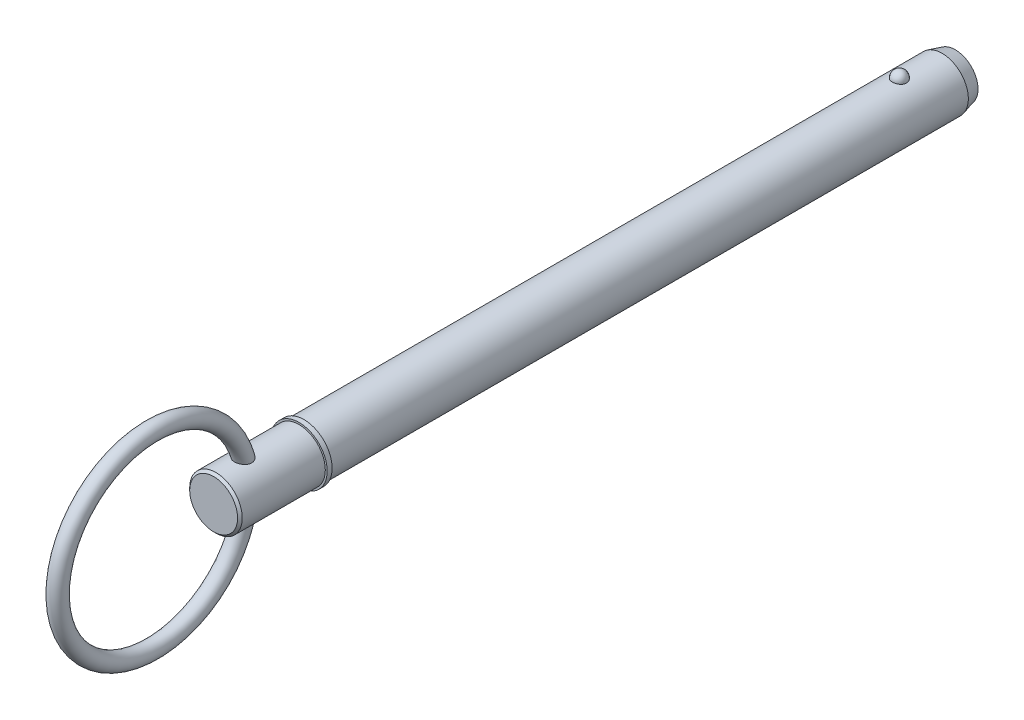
ISO-10303-21;
HEADER;
FILE_DESCRIPTION(('STEP AP214'),'2;1');
FILE_NAME('part.step','',(''),(''),'','','');
FILE_SCHEMA(('AUTOMOTIVE_DESIGN { 1 0 10303 214 1 1 1 1 }'));
ENDSEC;
DATA;
#1=APPLICATION_CONTEXT('core data for automotive mechanical design processes');
#2=APPLICATION_PROTOCOL_DEFINITION('international standard','automotive_design',2000,#1);
#3=PRODUCT_CONTEXT('',#1,'mechanical');
#4=PRODUCT('Part','Part','',(#3));
#5=PRODUCT_RELATED_PRODUCT_CATEGORY('part','',(#4));
#6=PRODUCT_DEFINITION_FORMATION('','',#4);
#7=PRODUCT_DEFINITION_CONTEXT('part definition',#1,'design');
#8=PRODUCT_DEFINITION('design','',#6,#7);
#9=PRODUCT_DEFINITION_SHAPE('','',#8);
#10=(LENGTH_UNIT() NAMED_UNIT(*) SI_UNIT(.MILLI.,.METRE.));
#11=(NAMED_UNIT(*) PLANE_ANGLE_UNIT() SI_UNIT($,.RADIAN.));
#12=(NAMED_UNIT(*) SI_UNIT($,.STERADIAN.) SOLID_ANGLE_UNIT());
#13=UNCERTAINTY_MEASURE_WITH_UNIT(LENGTH_MEASURE(1.E-05),#10,'distance_accuracy_value','');
#14=(GEOMETRIC_REPRESENTATION_CONTEXT(3) GLOBAL_UNCERTAINTY_ASSIGNED_CONTEXT((#13)) GLOBAL_UNIT_ASSIGNED_CONTEXT((#10,
#11,#12)) REPRESENTATION_CONTEXT('',''));
#15=CARTESIAN_POINT('',(0.,0.,0.));
#16=DIRECTION('',(0.,0.,1.));
#17=DIRECTION('',(1.,0.,0.));
#18=AXIS2_PLACEMENT_3D('',#15,#16,#17);
#19=CARTESIAN_POINT('',(0.,0.,177.8));
#20=DIRECTION('',(0.,0.,-1.));
#21=DIRECTION('',(-1.,0.,0.));
#22=AXIS2_PLACEMENT_3D('',#19,#20,#21);
#23=CYLINDRICAL_SURFACE('',#22,7.94);
#24=CARTESIAN_POINT('',(2.13020349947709,7.64891057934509,-2.14999999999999));
#25=CARTESIAN_POINT('',(2.1302012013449,7.64891247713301,-2.02978166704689));
#26=CARTESIAN_POINT('',(2.12037546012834,7.65166842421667,-1.90953383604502));
#27=CARTESIAN_POINT('',(2.08130792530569,7.66238579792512,-1.67243962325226));
#28=CARTESIAN_POINT('',(2.05205785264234,7.67034944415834,-1.55559471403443));
#29=CARTESIAN_POINT('',(1.97489181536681,7.69057749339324,-1.32869361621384));
#30=CARTESIAN_POINT('',(1.92698409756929,7.70283999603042,-1.21863445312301));
#31=CARTESIAN_POINT('',(1.81370645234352,7.73029430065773,-1.00831338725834));
#32=CARTESIAN_POINT('',(1.74833715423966,7.7454859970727,-0.908051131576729));
#33=CARTESIAN_POINT('',(1.60144242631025,7.77718699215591,-0.719628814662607));
#34=CARTESIAN_POINT('',(1.51984382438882,7.7937020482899,-0.631526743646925));
#35=CARTESIAN_POINT('',(1.34279837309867,7.82614685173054,-0.470411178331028));
#36=CARTESIAN_POINT('',(1.24735148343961,7.84207659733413,-0.397397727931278));
#37=CARTESIAN_POINT('',(1.04544839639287,7.87153116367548,-0.268681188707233));
#38=CARTESIAN_POINT('',(0.939022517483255,7.88506234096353,-0.212932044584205));
#39=CARTESIAN_POINT('',(0.717931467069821,7.90825597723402,-0.120080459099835));
#40=CARTESIAN_POINT('',(0.603267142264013,7.9179188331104,-0.0829761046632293));
#41=CARTESIAN_POINT('',(0.371015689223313,7.93216561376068,-0.0289596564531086));
#42=CARTESIAN_POINT('',(0.253510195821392,7.93683225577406,-0.0117183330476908));
#43=CARTESIAN_POINT('',(0.0171784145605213,7.94086051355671,0.00318921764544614));
#44=CARTESIAN_POINT('',(-0.101647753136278,7.94022260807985,0.000857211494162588));
#45=CARTESIAN_POINT('',(-0.335567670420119,7.93375751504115,-0.023146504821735));
#46=CARTESIAN_POINT('',(-0.450690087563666,7.92799987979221,-0.0445590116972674));
#47=CARTESIAN_POINT('',(-0.675610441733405,7.91200792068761,-0.10576054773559));
#48=CARTESIAN_POINT('',(-0.785408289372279,7.90177352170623,-0.145549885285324));
#49=CARTESIAN_POINT('',(-0.9972706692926,7.87784802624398,-0.242675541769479));
#50=CARTESIAN_POINT('',(-1.0992893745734,7.86413823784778,-0.300107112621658));
#51=CARTESIAN_POINT('',(-1.29223659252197,7.83474718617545,-0.430887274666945));
#52=CARTESIAN_POINT('',(-1.38316404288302,7.81906573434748,-0.504237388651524));
#53=CARTESIAN_POINT('',(-1.55313516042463,7.78710451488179,-0.666358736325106));
#54=CARTESIAN_POINT('',(-1.63193689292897,7.77081906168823,-0.755382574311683));
#55=CARTESIAN_POINT('',(-1.77366356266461,7.73970270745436,-0.945507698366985));
#56=CARTESIAN_POINT('',(-1.83658745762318,7.72487190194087,-1.04660977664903));
#57=CARTESIAN_POINT('',(-1.94556640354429,7.6981535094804,-1.25927689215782));
#58=CARTESIAN_POINT('',(-1.99143480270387,7.6862989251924,-1.3709418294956));
#59=CARTESIAN_POINT('',(-2.06418311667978,7.66708387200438,-1.60066153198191));
#60=CARTESIAN_POINT('',(-2.0910635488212,7.65972328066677,-1.71871612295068));
#61=CARTESIAN_POINT('',(-2.12508507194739,7.65035479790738,-1.9573607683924));
#62=CARTESIAN_POINT('',(-2.13230490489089,7.64832555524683,-2.07793875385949));
#63=CARTESIAN_POINT('',(-2.12704767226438,7.64978921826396,-2.31862835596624));
#64=CARTESIAN_POINT('',(-2.1145710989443,7.6532819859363,-2.43873998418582));
#65=CARTESIAN_POINT('',(-2.07034166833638,7.66536368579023,-2.67451689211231));
#66=CARTESIAN_POINT('',(-2.03867758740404,7.67392914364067,-2.79020005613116));
#67=CARTESIAN_POINT('',(-1.95694065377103,7.69517736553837,-3.01446692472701));
#68=CARTESIAN_POINT('',(-1.90686710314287,7.70786028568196,-3.12305035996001));
#69=CARTESIAN_POINT('',(-1.78925555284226,7.73600831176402,-3.33065971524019));
#70=CARTESIAN_POINT('',(-1.72162904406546,7.75148739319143,-3.42963360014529));
#71=CARTESIAN_POINT('',(-1.57074739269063,7.78346215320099,-3.61466914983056));
#72=CARTESIAN_POINT('',(-1.48749169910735,7.79995786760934,-3.70073035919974));
#73=CARTESIAN_POINT('',(-1.30720250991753,7.83219119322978,-3.8578359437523));
#74=CARTESIAN_POINT('',(-1.2101234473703,7.84792605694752,-3.92882863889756));
#75=CARTESIAN_POINT('',(-1.00503150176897,7.87681523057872,-4.05342383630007));
#76=CARTESIAN_POINT('',(-0.897019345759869,7.88996971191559,-4.10702749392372));
#77=CARTESIAN_POINT('',(-0.674439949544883,7.91208451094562,-4.19477736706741));
#78=CARTESIAN_POINT('',(-0.55996501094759,7.92109245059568,-4.22914554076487));
#79=CARTESIAN_POINT('',(-0.326625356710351,7.93413878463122,-4.27838865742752));
#80=CARTESIAN_POINT('',(-0.20776113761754,7.93817773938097,-4.29326579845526));
#81=CARTESIAN_POINT('',(0.0287357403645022,7.94081322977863,-4.3030062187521));
#82=CARTESIAN_POINT('',(0.14635312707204,7.93950453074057,-4.29821797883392));
#83=CARTESIAN_POINT('',(0.379062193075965,7.93180098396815,-4.26955229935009));
#84=CARTESIAN_POINT('',(0.494153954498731,7.92540630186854,-4.24567548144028));
#85=CARTESIAN_POINT('',(0.718185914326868,7.90824874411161,-4.17962260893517));
#86=CARTESIAN_POINT('',(0.827145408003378,7.89750055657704,-4.13750805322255));
#87=CARTESIAN_POINT('',(1.03638036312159,7.87277755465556,-4.03615078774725));
#88=CARTESIAN_POINT('',(1.13665531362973,7.85880255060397,-3.97690707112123));
#89=CARTESIAN_POINT('',(1.32729731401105,7.82887859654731,-3.84189297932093));
#90=CARTESIAN_POINT('',(1.41749828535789,7.81290379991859,-3.76589388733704));
#91=CARTESIAN_POINT('',(1.58397257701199,7.78086330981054,-3.59992466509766));
#92=CARTESIAN_POINT('',(1.66024342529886,7.76479760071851,-3.50995206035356));
#93=CARTESIAN_POINT('',(1.79805631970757,7.73405928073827,-3.3168832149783));
#94=CARTESIAN_POINT('',(1.85933944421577,7.719413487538,-3.213597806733));
#95=CARTESIAN_POINT('',(1.96397499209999,7.69345992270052,-2.99796163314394));
#96=CARTESIAN_POINT('',(2.00733488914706,7.68215076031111,-2.88561466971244));
#97=CARTESIAN_POINT('',(2.07068045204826,7.66529896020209,-2.6699413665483));
#98=CARTESIAN_POINT('',(2.09296296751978,7.65919990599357,-2.56732606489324));
#99=CARTESIAN_POINT('',(2.12272535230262,7.65100492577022,-2.35981463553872));
#100=CARTESIAN_POINT('',(2.13020550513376,7.64890892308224,-2.25491855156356));
#101=CARTESIAN_POINT('',(2.13020349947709,7.64891057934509,-2.14999999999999));
#102=B_SPLINE_CURVE_WITH_KNOTS('',3,(#24,#25,#26,#27,#28,#29,#30,#31,#32,#33,#34,#35,#36,#37,
#38,#39,#40,#41,#42,#43,#44,#45,#46,#47,#48,#49,#50,#51,#52,#53,#54,#55,#56,#57,#58,#59,#60,#61,
#62,#63,#64,#65,#66,#67,#68,#69,#70,#71,#72,#73,#74,#75,#76,#77,#78,#79,#80,#81,#82,#83,#84,#85,
#86,#87,#88,#89,#90,#91,#92,#93,#94,#95,#96,#97,#98,#99,#100,#101),.UNSPECIFIED.,.T.,.F.,(4,2,2,
2,2,2,2,2,2,2,2,2,2,2,2,2,2,2,2,2,2,2,2,2,2,2,2,2,2,2,2,2,2,2,2,2,2,2,4),(0.,0.360277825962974,
0.720709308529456,1.0809816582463,1.44124102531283,1.80316307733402,2.16508618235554,
2.52603531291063,2.88694740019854,3.24178717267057,3.59659491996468,3.94665496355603,
4.29672088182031,4.64871108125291,5.0007349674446,5.3590619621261,5.71741247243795,
6.079576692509,6.44173104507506,6.80243279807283,7.16312553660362,7.52216203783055,
7.88121215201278,8.24210915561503,8.60301888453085,8.96514709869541,9.32725124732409,
9.68508606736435,10.0428805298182,10.3943622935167,10.7458326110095,11.0961268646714,
11.4464417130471,11.8018724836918,12.1573662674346,12.5186252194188,12.8797333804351,
13.1941658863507,13.5085923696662),.UNSPECIFIED.);
#103=CARTESIAN_POINT('',(2.13020349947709,7.64891057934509,-2.14999999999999));
#104=VERTEX_POINT('',#103);
#105=EDGE_CURVE('E102',#104,#104,#102,.T.);
#106=ORIENTED_EDGE('',*,*,#105,.T.);
#107=EDGE_LOOP('',(#106));
#108=FACE_BOUND('',#107,.T.);
#109=CARTESIAN_POINT('',(0.,0.,-15.05));
#110=DIRECTION('',(0.,0.,-1.));
#111=DIRECTION('',(-1.,0.,0.));
#112=AXIS2_PLACEMENT_3D('',#109,#110,#111);
#113=CIRCLE('',#112,7.94);
#114=CARTESIAN_POINT('',(-7.94,0.,-15.05));
#115=VERTEX_POINT('',#114);
#116=EDGE_CURVE('E110',#115,#115,#113,.F.);
#117=ORIENTED_EDGE('',*,*,#116,.T.);
#118=EDGE_LOOP('',(#117));
#119=FACE_BOUND('',#118,.T.);
#120=CARTESIAN_POINT('',(0.,0.,177.8));
#121=DIRECTION('',(0.,0.,1.));
#122=DIRECTION('',(1.,0.,0.));
#123=AXIS2_PLACEMENT_3D('',#120,#121,#122);
#124=CIRCLE('',#123,7.94);
#125=CARTESIAN_POINT('',(7.94,0.,177.8));
#126=VERTEX_POINT('',#125);
#127=EDGE_CURVE('E108',#126,#126,#124,.T.);
#128=ORIENTED_EDGE('',*,*,#127,.F.);
#129=EDGE_LOOP('',(#128));
#130=FACE_BOUND('',#129,.T.);
#131=ADVANCED_FACE('F39',(#108,#119,#130),#23,.T.);
#132=CARTESIAN_POINT('',(0.,0.,-19.05));
#133=DIRECTION('',(0.,0.,-1.));
#134=DIRECTION('',(-1.,0.,0.));
#135=AXIS2_PLACEMENT_3D('',#132,#133,#134);
#136=PLANE('',#135);
#137=CARTESIAN_POINT('',(0.,0.,-19.05));
#138=DIRECTION('',(0.,0.,-1.));
#139=DIRECTION('',(-1.,0.,0.));
#140=AXIS2_PLACEMENT_3D('',#137,#138,#139);
#141=CIRCLE('',#140,6.86820323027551);
#142=CARTESIAN_POINT('',(-6.86820323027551,0.,-19.05));
#143=VERTEX_POINT('',#142);
#144=EDGE_CURVE('E142',#143,#143,#141,.T.);
#145=ORIENTED_EDGE('',*,*,#144,.T.);
#146=EDGE_LOOP('',(#145));
#147=FACE_BOUND('',#146,.T.);
#148=ADVANCED_FACE('F88',(#147),#136,.T.);
#149=CARTESIAN_POINT('',(0.,0.,-19.05));
#150=DIRECTION('',(0.,0.,1.));
#151=DIRECTION('',(1.,0.,0.));
#152=AXIS2_PLACEMENT_3D('',#149,#150,#151);
#153=CONICAL_SURFACE('',#152,6.86820323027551,0.261799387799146);
#154=ORIENTED_EDGE('',*,*,#116,.F.);
#155=EDGE_LOOP('',(#154));
#156=FACE_BOUND('',#155,.T.);
#157=ORIENTED_EDGE('',*,*,#144,.F.);
#158=EDGE_LOOP('',(#157));
#159=FACE_BOUND('',#158,.T.);
#160=ADVANCED_FACE('F94',(#156,#159),#153,.T.);
#161=CARTESIAN_POINT('',(0.,7.94,-2.14999999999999));
#162=DIRECTION('',(0.,1.,0.));
#163=DIRECTION('',(0.,0.,1.));
#164=AXIS2_PLACEMENT_3D('',#161,#162,#163);
#165=SPHERICAL_SURFACE('',#164,2.15);
#166=ORIENTED_EDGE('',*,*,#105,.F.);
#167=EDGE_LOOP('',(#166));
#168=FACE_BOUND('',#167,.T.);
#169=ADVANCED_FACE('F113',(#168),#165,.T.);
#170=CARTESIAN_POINT('',(0.,0.,177.8));
#171=DIRECTION('',(0.,0.,-1.));
#172=DIRECTION('',(-1.,0.,0.));
#173=AXIS2_PLACEMENT_3D('',#170,#171,#172);
#174=PLANE('',#173);
#175=ORIENTED_EDGE('',*,*,#127,.T.);
#176=EDGE_LOOP('',(#175));
#177=FACE_BOUND('',#176,.T.);
#178=CARTESIAN_POINT('',(0.,0.,177.8));
#179=DIRECTION('',(0.,0.,-1.));
#180=DIRECTION('',(-1.,0.,0.));
#181=AXIS2_PLACEMENT_3D('',#178,#179,#180);
#182=CIRCLE('',#181,8.5);
#183=CARTESIAN_POINT('',(-8.5,0.,177.8));
#184=VERTEX_POINT('',#183);
#185=EDGE_CURVE('E109',#184,#184,#182,.T.);
#186=ORIENTED_EDGE('',*,*,#185,.T.);
#187=EDGE_LOOP('',(#186));
#188=FACE_BOUND('',#187,.T.);
#189=ADVANCED_FACE('F117',(#177,#188),#174,.T.);
#190=CARTESIAN_POINT('',(0.,0.,33.7287874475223));
#191=DIRECTION('',(0.,0.,-1.));
#192=DIRECTION('',(-1.,0.,0.));
#193=AXIS2_PLACEMENT_3D('',#190,#191,#192);
#194=CYLINDRICAL_SURFACE('',#193,8.5);
#195=CARTESIAN_POINT('',(0.,0.,179.3));
#196=DIRECTION('',(0.,0.,-1.));
#197=DIRECTION('',(-1.,0.,0.));
#198=AXIS2_PLACEMENT_3D('',#195,#196,#197);
#199=CIRCLE('',#198,8.5);
#200=CARTESIAN_POINT('',(-8.5,0.,179.3));
#201=VERTEX_POINT('',#200);
#202=EDGE_CURVE('E134',#201,#201,#199,.T.);
#203=ORIENTED_EDGE('',*,*,#202,.T.);
#204=EDGE_LOOP('',(#203));
#205=FACE_BOUND('',#204,.T.);
#206=ORIENTED_EDGE('',*,*,#185,.F.);
#207=EDGE_LOOP('',(#206));
#208=FACE_BOUND('',#207,.T.);
#209=ADVANCED_FACE('F121',(#205,#208),#194,.T.);
#210=CARTESIAN_POINT('',(0.,8.5,179.3));
#211=DIRECTION('',(0.,0.,1.));
#212=DIRECTION('',(1.,0.,0.));
#213=AXIS2_PLACEMENT_3D('',#210,#211,#212);
#214=PLANE('',#213);
#215=CARTESIAN_POINT('',(0.,0.,179.3));
#216=DIRECTION('',(0.,0.,1.));
#217=DIRECTION('',(1.,0.,0.));
#218=AXIS2_PLACEMENT_3D('',#215,#216,#217);
#219=CIRCLE('',#218,7.94);
#220=CARTESIAN_POINT('',(7.94,0.,179.3));
#221=VERTEX_POINT('',#220);
#222=EDGE_CURVE('E112',#221,#221,#219,.T.);
#223=ORIENTED_EDGE('',*,*,#222,.F.);
#224=EDGE_LOOP('',(#223));
#225=FACE_BOUND('',#224,.T.);
#226=ORIENTED_EDGE('',*,*,#202,.F.);
#227=EDGE_LOOP('',(#226));
#228=FACE_BOUND('',#227,.T.);
#229=ADVANCED_FACE('F85',(#225,#228),#214,.T.);
#230=CARTESIAN_POINT('',(0.,0.,205.11));
#231=DIRECTION('',(0.,0.,-1.));
#232=DIRECTION('',(-1.,0.,0.));
#233=AXIS2_PLACEMENT_3D('',#230,#231,#232);
#234=CYLINDRICAL_SURFACE('',#233,7.94);
#235=CARTESIAN_POINT('',(-1.15544091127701,-7.85547938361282,193.911910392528));
#236=CARTESIAN_POINT('',(-1.03089695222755,-7.87379554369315,193.849615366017));
#237=CARTESIAN_POINT('',(-0.900845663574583,-7.8898743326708,193.797593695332));
#238=CARTESIAN_POINT('',(-0.633417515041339,-7.91583465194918,193.715265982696));
#239=CARTESIAN_POINT('',(-0.496037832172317,-7.92571377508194,193.684968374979));
#240=CARTESIAN_POINT('',(-0.217881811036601,-7.93823020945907,193.646773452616));
#241=CARTESIAN_POINT('',(-0.0771057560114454,-7.94086812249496,193.638874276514));
#242=CARTESIAN_POINT('',(0.203828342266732,-7.93862624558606,193.645648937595));
#243=CARTESIAN_POINT('',(0.343986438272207,-7.93374711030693,193.660320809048));
#244=CARTESIAN_POINT('',(0.619544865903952,-7.9169944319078,193.711877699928));
#245=CARTESIAN_POINT('',(0.754950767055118,-7.9051293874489,193.748735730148));
#246=CARTESIAN_POINT('',(1.01737529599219,-7.8756583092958,193.843842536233));
#247=CARTESIAN_POINT('',(1.14439334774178,-7.85805188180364,193.902092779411));
#248=CARTESIAN_POINT('',(1.38668443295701,-7.81893907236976,194.038842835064));
#249=CARTESIAN_POINT('',(1.50193494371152,-7.79742542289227,194.117380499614));
#250=CARTESIAN_POINT('',(1.71711272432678,-7.75288428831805,194.292872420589));
#251=CARTESIAN_POINT('',(1.81704089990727,-7.72985689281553,194.389825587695));
#252=CARTESIAN_POINT('',(1.99787261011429,-7.68509802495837,194.59887149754));
#253=CARTESIAN_POINT('',(2.07893183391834,-7.66335713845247,194.710827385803));
#254=CARTESIAN_POINT('',(2.2207658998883,-7.62346723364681,194.947480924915));
#255=CARTESIAN_POINT('',(2.28154607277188,-7.6053172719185,195.072175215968));
#256=CARTESIAN_POINT('',(2.38011540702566,-7.57504217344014,195.327618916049));
#257=CARTESIAN_POINT('',(2.41840843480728,-7.56278621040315,195.458158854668));
#258=CARTESIAN_POINT('',(2.47363993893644,-7.54490265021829,195.724095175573));
#259=CARTESIAN_POINT('',(2.49057788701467,-7.53927521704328,195.859491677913));
#260=CARTESIAN_POINT('',(2.50351014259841,-7.53499042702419,196.13242871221));
#261=CARTESIAN_POINT('',(2.49933630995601,-7.53638902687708,196.269977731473));
#262=CARTESIAN_POINT('',(2.47072547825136,-7.54581524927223,196.542698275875));
#263=CARTESIAN_POINT('',(2.44628184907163,-7.55384504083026,196.677869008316));
#264=CARTESIAN_POINT('',(2.37589315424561,-7.57629160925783,196.953085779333));
#265=CARTESIAN_POINT('',(2.32844094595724,-7.5911515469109,197.09270896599));
#266=CARTESIAN_POINT('',(2.21332780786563,-7.62550828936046,197.362781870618));
#267=CARTESIAN_POINT('',(2.14565489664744,-7.64500784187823,197.493226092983));
#268=CARTESIAN_POINT('',(1.98438755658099,-7.68852412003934,197.753702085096));
#269=CARTESIAN_POINT('',(1.88896913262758,-7.71279219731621,197.882569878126));
#270=CARTESIAN_POINT('',(1.67743245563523,-7.7615471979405,198.122112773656));
#271=CARTESIAN_POINT('',(1.56130644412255,-7.78603420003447,198.232781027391));
#272=CARTESIAN_POINT('',(1.31168281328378,-7.83191501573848,198.430100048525));
#273=CARTESIAN_POINT('',(1.1784163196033,-7.85334315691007,198.517029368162));
#274=CARTESIAN_POINT('',(0.967442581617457,-7.88116219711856,198.626657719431));
#275=CARTESIAN_POINT('',(0.895283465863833,-7.88971376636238,198.659736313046));
#276=CARTESIAN_POINT('',(0.747777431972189,-7.90505596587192,198.718400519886));
#277=CARTESIAN_POINT('',(0.672431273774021,-7.91184701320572,198.743987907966));
#278=CARTESIAN_POINT('',(0.530575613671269,-7.92252382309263,198.783912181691));
#279=CARTESIAN_POINT('',(0.464394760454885,-7.92668987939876,198.799349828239));
#280=CARTESIAN_POINT('',(0.330815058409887,-7.9333870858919,198.824069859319));
#281=CARTESIAN_POINT('',(0.263416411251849,-7.93591850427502,198.83335325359));
#282=CARTESIAN_POINT('',(0.128041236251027,-7.93925585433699,198.845577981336));
#283=CARTESIAN_POINT('',(0.0600650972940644,-7.94006286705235,198.848523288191));
#284=CARTESIAN_POINT('',(-0.0758408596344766,-7.93992929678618,198.848033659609));
#285=CARTESIAN_POINT('',(-0.143770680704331,-7.93898884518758,198.844599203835));
#286=CARTESIAN_POINT('',(-0.330023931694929,-7.93402174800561,198.826406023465));
#287=CARTESIAN_POINT('',(-0.447720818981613,-7.92820264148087,198.805060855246));
#288=CARTESIAN_POINT('',(-0.677833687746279,-7.91185818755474,198.744093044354));
#289=CARTESIAN_POINT('',(-0.790248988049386,-7.90133223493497,198.704468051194));
#290=CARTESIAN_POINT('',(-1.01082100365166,-7.87620111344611,198.607436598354));
#291=CARTESIAN_POINT('',(-1.1187367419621,-7.86147932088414,198.549515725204));
#292=CARTESIAN_POINT('',(-1.32464461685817,-7.8294189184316,198.418755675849));
#293=CARTESIAN_POINT('',(-1.42263264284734,-7.81207923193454,198.345910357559));
#294=CARTESIAN_POINT('',(-1.62038324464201,-7.77363945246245,198.176536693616));
#295=CARTESIAN_POINT('',(-1.7184938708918,-7.75235190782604,198.078123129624));
#296=CARTESIAN_POINT('',(-1.89908721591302,-7.71010284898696,197.867783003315));
#297=CARTESIAN_POINT('',(-1.9815587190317,-7.68914157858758,197.755846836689));
#298=CARTESIAN_POINT('',(-2.1397427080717,-7.64674394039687,197.505108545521));
#299=CARTESIAN_POINT('',(-2.21304020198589,-7.62562536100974,197.364719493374));
#300=CARTESIAN_POINT('',(-2.33615659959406,-7.5888154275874,197.073266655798));
#301=CARTESIAN_POINT('',(-2.38596943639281,-7.57312547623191,196.922200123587));
#302=CARTESIAN_POINT('',(-2.46059473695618,-7.54921618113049,196.610492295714));
#303=CARTESIAN_POINT('',(-2.48494918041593,-7.54113395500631,196.449728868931));
#304=CARTESIAN_POINT('',(-2.50480773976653,-7.53456588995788,196.126244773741));
#305=CARTESIAN_POINT('',(-2.50033692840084,-7.53607171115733,195.963525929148));
#306=CARTESIAN_POINT('',(-2.46306926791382,-7.54832452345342,195.657165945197));
#307=CARTESIAN_POINT('',(-2.4329569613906,-7.55819528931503,195.513162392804));
#308=CARTESIAN_POINT('',(-2.34806892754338,-7.58499431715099,195.233304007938));
#309=CARTESIAN_POINT('',(-2.29330013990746,-7.60192059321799,195.097446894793));
#310=CARTESIAN_POINT('',(-2.16523724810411,-7.63933506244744,194.84765733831));
#311=CARTESIAN_POINT('',(-2.09353456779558,-7.65948502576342,194.732853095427));
#312=CARTESIAN_POINT('',(-1.93200913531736,-7.7018104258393,194.517268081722));
#313=CARTESIAN_POINT('',(-1.842192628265,-7.72398516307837,194.416482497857));
#314=CARTESIAN_POINT('',(-1.65746337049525,-7.76558957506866,194.24131484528));
#315=CARTESIAN_POINT('',(-1.56413624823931,-7.78505810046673,194.165259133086));
#316=CARTESIAN_POINT('',(-1.36706423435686,-7.82207051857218,194.02753576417));
#317=CARTESIAN_POINT('',(-1.26331856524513,-7.83961426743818,193.965869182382));
#318=CARTESIAN_POINT('',(-1.15544091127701,-7.85547938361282,193.911910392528));
#319=B_SPLINE_CURVE_WITH_KNOTS('',3,(#235,#236,#237,#238,#239,#240,#241,#242,#243,#244,#245,
#246,#247,#248,#249,#250,#251,#252,#253,#254,#255,#256,#257,#258,#259,#260,#261,#262,#263,#264,
#265,#266,#267,#268,#269,#270,#271,#272,#273,#274,#275,#276,#277,#278,#279,#280,#281,#282,#283,
#284,#285,#286,#287,#288,#289,#290,#291,#292,#293,#294,#295,#296,#297,#298,#299,#300,#301,#302,
#303,#304,#305,#306,#307,#308,#309,#310,#311,#312,#313,#314,#315,#316,#317,#318),.UNSPECIFIED.,
.T.,.F.,(4,2,2,2,2,2,2,2,2,2,2,2,2,2,2,2,2,2,2,2,2,2,2,2,2,2,2,2,2,2,2,2,2,2,2,2,2,2,2,2,2,4),
(0.,0.420927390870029,0.842018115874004,1.26307384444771,1.68409290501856,2.10460083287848,
2.52513760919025,2.94646475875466,3.36776699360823,3.7854589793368,4.20304108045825,
4.61086922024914,5.01870744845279,5.42979890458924,5.84102487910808,6.28383316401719,
6.72690434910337,7.21113455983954,7.6955465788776,8.17400305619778,8.41316278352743,
8.65226580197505,8.85622998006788,9.06016068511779,9.26396350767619,9.4677510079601,
9.8252104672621,10.1827159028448,10.5513335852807,10.9201032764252,11.3402098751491,
11.7606166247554,12.2377707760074,12.715048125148,13.2007716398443,13.6860727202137,
14.1260485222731,14.5659005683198,14.9745225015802,15.3830037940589,15.7475760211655,
16.1121754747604),.UNSPECIFIED.);
#320=CARTESIAN_POINT('',(-1.15544091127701,-7.85547938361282,193.911910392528));
#321=VERTEX_POINT('',#320);
#322=EDGE_CURVE('E10',#321,#321,#319,.T.);
#323=ORIENTED_EDGE('',*,*,#322,.F.);
#324=EDGE_LOOP('',(#323));
#325=FACE_BOUND('',#324,.T.);
#326=CARTESIAN_POINT('',(-1.15544091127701,7.85547938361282,193.911910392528));
#327=CARTESIAN_POINT('',(-1.278579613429,7.83736699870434,193.973507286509));
#328=CARTESIAN_POINT('',(-1.39638360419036,7.8170599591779,194.045172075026));
#329=CARTESIAN_POINT('',(-1.61803025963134,7.77421032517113,194.20708252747));
#330=CARTESIAN_POINT('',(-1.72186951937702,7.7516671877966,194.297332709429));
#331=CARTESIAN_POINT('',(-1.91269683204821,7.70680387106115,194.494395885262));
#332=CARTESIAN_POINT('',(-1.99967065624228,7.68448389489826,194.601222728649));
#333=CARTESIAN_POINT('',(-2.15412555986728,7.64262858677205,194.828607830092));
#334=CARTESIAN_POINT('',(-2.22161184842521,7.62309251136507,194.949162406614));
#335=CARTESIAN_POINT('',(-2.3342927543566,7.5893410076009,195.198377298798));
#336=CARTESIAN_POINT('',(-2.3798562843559,7.57503857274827,195.326859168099));
#337=CARTESIAN_POINT('',(-2.44955571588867,7.55278941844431,195.590011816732));
#338=CARTESIAN_POINT('',(-2.47369226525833,7.544842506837,195.72468240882));
#339=CARTESIAN_POINT('',(-2.50059611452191,7.53596831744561,195.996137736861));
#340=CARTESIAN_POINT('',(-2.50339277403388,7.53503139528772,196.132919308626));
#341=CARTESIAN_POINT('',(-2.48855779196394,7.53994222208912,196.405224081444));
#342=CARTESIAN_POINT('',(-2.47092012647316,7.54579197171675,196.54074689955));
#343=CARTESIAN_POINT('',(-2.41469361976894,7.56397908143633,196.816293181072));
#344=CARTESIAN_POINT('',(-2.37479606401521,7.57671999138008,196.95602135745));
#345=CARTESIAN_POINT('',(-2.27489955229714,7.60730881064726,197.227515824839));
#346=CARTESIAN_POINT('',(-2.2148900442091,7.6251594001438,197.359277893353));
#347=CARTESIAN_POINT('',(-2.06943931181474,7.66598084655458,197.62452508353));
#348=CARTESIAN_POINT('',(-1.98208275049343,7.68928197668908,197.756914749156));
#349=CARTESIAN_POINT('',(-1.78658869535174,7.73704343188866,198.005235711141));
#350=CARTESIAN_POINT('',(-1.67843905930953,7.76150442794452,198.121157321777));
#351=CARTESIAN_POINT('',(-1.44142605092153,7.80900750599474,198.333699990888));
#352=CARTESIAN_POINT('',(-1.31231821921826,7.83202775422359,198.430058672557));
#353=CARTESIAN_POINT('',(-1.10627655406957,7.86286215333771,198.554614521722));
#354=CARTESIAN_POINT('',(-1.03552563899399,7.87252500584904,198.592805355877));
#355=CARTESIAN_POINT('',(-0.890375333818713,7.89025728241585,198.661885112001));
#356=CARTESIAN_POINT('',(-0.815978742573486,7.89832790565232,198.692779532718));
#357=CARTESIAN_POINT('',(-0.674180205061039,7.91160332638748,198.743082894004));
#358=CARTESIAN_POINT('',(-0.607145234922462,7.91704543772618,198.763468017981));
#359=CARTESIAN_POINT('',(-0.471385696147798,7.92628663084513,198.797876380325));
#360=CARTESIAN_POINT('',(-0.402662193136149,7.93008672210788,198.811903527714));
#361=CARTESIAN_POINT('',(-0.264153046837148,7.9359070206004,198.833322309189));
#362=CARTESIAN_POINT('',(-0.194368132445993,7.9379283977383,198.840718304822));
#363=CARTESIAN_POINT('',(-0.0544054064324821,7.94012285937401,198.848743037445));
#364=CARTESIAN_POINT('',(0.0157723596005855,7.94029615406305,198.849372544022));
#365=CARTESIAN_POINT('',(0.206295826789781,7.93822912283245,198.841825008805));
#366=CARTESIAN_POINT('',(0.326425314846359,7.93416340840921,198.826989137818));
#367=CARTESIAN_POINT('',(0.562310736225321,7.92094769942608,198.778077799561));
#368=CARTESIAN_POINT('',(0.67806631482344,7.91179729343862,198.74400077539));
#369=CARTESIAN_POINT('',(0.903029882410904,7.88929555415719,198.658269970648));
#370=CARTESIAN_POINT('',(1.01220356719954,7.87592415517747,198.606532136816));
#371=CARTESIAN_POINT('',(1.22142047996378,7.84620431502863,198.487793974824));
#372=CARTESIAN_POINT('',(1.32146048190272,7.82985482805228,198.420788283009));
#373=CARTESIAN_POINT('',(1.52328754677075,7.7932678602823,198.264309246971));
#374=CARTESIAN_POINT('',(1.6236508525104,7.77280069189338,198.173056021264));
#375=CARTESIAN_POINT('',(1.80985117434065,7.73156849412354,197.976815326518));
#376=CARTESIAN_POINT('',(1.895678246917,7.71080327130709,197.87181854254));
#377=CARTESIAN_POINT('',(2.06302404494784,7.66785771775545,197.634543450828));
#378=CARTESIAN_POINT('',(2.1421317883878,7.64590590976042,197.500514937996));
#379=CARTESIAN_POINT('',(2.27825755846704,7.60645646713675,197.220994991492));
#380=CARTESIAN_POINT('',(2.33526577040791,7.58896081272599,197.075498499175));
#381=CARTESIAN_POINT('',(2.42707573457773,7.56011538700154,196.770242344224));
#382=CARTESIAN_POINT('',(2.4608459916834,7.54905411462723,196.610140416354));
#383=CARTESIAN_POINT('',(2.49980168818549,7.53624914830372,196.286129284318));
#384=CARTESIAN_POINT('',(2.50500938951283,7.5344981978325,196.122223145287));
#385=CARTESIAN_POINT('',(2.48594104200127,7.54080673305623,195.809976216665));
#386=CARTESIAN_POINT('',(2.46407777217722,7.54806351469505,195.661473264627));
#387=CARTESIAN_POINT('',(2.3945479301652,7.57040718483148,195.371258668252));
#388=CARTESIAN_POINT('',(2.34689355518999,7.58549037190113,195.229543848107));
#389=CARTESIAN_POINT('',(2.2318274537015,7.62009243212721,194.969141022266));
#390=CARTESIAN_POINT('',(2.16637710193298,7.63914093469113,194.849517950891));
#391=CARTESIAN_POINT('',(2.01638736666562,7.68009146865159,194.62346099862));
#392=CARTESIAN_POINT('',(1.93184850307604,7.7019934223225,194.517026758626));
#393=CARTESIAN_POINT('',(1.74664202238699,7.74608439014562,194.32066977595));
#394=CARTESIAN_POINT('',(1.646079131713,7.76827073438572,194.23064744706));
#395=CARTESIAN_POINT('',(1.43119791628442,7.81071401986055,194.068308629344));
#396=CARTESIAN_POINT('',(1.31687846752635,7.83097080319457,193.995993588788));
#397=CARTESIAN_POINT('',(1.07477437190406,7.86789551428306,193.869149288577));
#398=CARTESIAN_POINT('',(0.946739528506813,7.88446964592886,193.815069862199));
#399=CARTESIAN_POINT('',(0.683029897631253,7.91167708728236,193.728213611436));
#400=CARTESIAN_POINT('',(0.54735441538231,7.92230985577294,193.695438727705));
#401=CARTESIAN_POINT('',(0.271066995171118,7.93658630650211,193.651730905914));
#402=CARTESIAN_POINT('',(0.130424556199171,7.94017418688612,193.640972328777));
#403=CARTESIAN_POINT('',(-0.150736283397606,7.93981282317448,193.642062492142));
#404=CARTESIAN_POINT('',(-0.291254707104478,7.93586558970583,193.653905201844));
#405=CARTESIAN_POINT('',(-0.556023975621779,7.92151946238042,193.697891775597));
#406=CARTESIAN_POINT('',(-0.68062174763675,7.91171585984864,193.728166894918));
#407=CARTESIAN_POINT('',(-0.923476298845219,7.88705844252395,193.806736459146));
#408=CARTESIAN_POINT('',(-1.04173303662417,7.87220459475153,193.855031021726));
#409=CARTESIAN_POINT('',(-1.15544091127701,7.85547938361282,193.911910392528));
#410=B_SPLINE_CURVE_WITH_KNOTS('',3,(#326,#327,#328,#329,#330,#331,#332,#333,#334,#335,#336,
#337,#338,#339,#340,#341,#342,#343,#344,#345,#346,#347,#348,#349,#350,#351,#352,#353,#354,#355,
#356,#357,#358,#359,#360,#361,#362,#363,#364,#365,#366,#367,#368,#369,#370,#371,#372,#373,#374,
#375,#376,#377,#378,#379,#380,#381,#382,#383,#384,#385,#386,#387,#388,#389,#390,#391,#392,#393,
#394,#395,#396,#397,#398,#399,#400,#401,#402,#403,#404,#405,#406,#407,#408,#409),.UNSPECIFIED.,
.T.,.F.,(4,2,2,2,2,2,2,2,2,2,2,2,2,2,2,2,2,2,2,2,2,2,2,2,2,2,2,2,2,2,2,2,2,2,2,2,2,2,2,2,2,4),
(0.,0.416167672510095,0.832436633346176,1.24905527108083,1.66556244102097,2.07479168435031,
2.48400855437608,2.89266231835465,3.30143658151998,3.73725068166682,4.17329379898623,
4.65204873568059,5.13108409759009,5.61617224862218,5.85876072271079,6.10116578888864,
6.31168904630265,6.52208269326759,6.73233785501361,6.9425691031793,7.30398888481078,
7.66543791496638,8.02863174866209,8.39195337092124,8.80190673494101,9.21213940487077,
9.68159903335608,10.1512669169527,10.6406305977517,11.1296128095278,11.5779838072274,
12.0261429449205,12.4372146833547,12.8482752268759,13.256751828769,13.6652618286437,
14.0832160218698,14.5012082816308,14.9224982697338,15.3436758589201,15.72796797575,
16.1122626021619),.UNSPECIFIED.);
#411=CARTESIAN_POINT('',(-1.15544091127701,7.85547938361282,193.911910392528));
#412=VERTEX_POINT('',#411);
#413=EDGE_CURVE('E51',#412,#412,#410,.T.);
#414=ORIENTED_EDGE('',*,*,#413,.F.);
#415=EDGE_LOOP('',(#414));
#416=FACE_BOUND('',#415,.T.);
#417=CARTESIAN_POINT('',(0.,0.,204.41));
#418=DIRECTION('',(0.,0.,-1.));
#419=DIRECTION('',(-1.,0.,0.));
#420=AXIS2_PLACEMENT_3D('',#417,#418,#419);
#421=CIRCLE('',#420,7.94);
#422=CARTESIAN_POINT('',(-7.94,0.,204.41));
#423=VERTEX_POINT('',#422);
#424=EDGE_CURVE('E64',#423,#423,#421,.T.);
#425=ORIENTED_EDGE('',*,*,#424,.T.);
#426=EDGE_LOOP('',(#425));
#427=FACE_BOUND('',#426,.T.);
#428=ORIENTED_EDGE('',*,*,#222,.T.);
#429=EDGE_LOOP('',(#428));
#430=FACE_BOUND('',#429,.T.);
#431=ADVANCED_FACE('F69',(#325,#416,#427,#430),#234,.T.);
#432=CARTESIAN_POINT('',(0.,0.,205.11));
#433=DIRECTION('',(0.,0.,-1.));
#434=DIRECTION('',(-1.,0.,0.));
#435=AXIS2_PLACEMENT_3D('',#432,#433,#434);
#436=PLANE('',#435);
#437=CARTESIAN_POINT('',(0.,0.,205.11));
#438=DIRECTION('',(0.,0.,-1.));
#439=DIRECTION('',(-1.,0.,0.));
#440=AXIS2_PLACEMENT_3D('',#437,#438,#439);
#441=CIRCLE('',#440,7.23999999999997);
#442=CARTESIAN_POINT('',(-7.23999999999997,0.,205.11));
#443=VERTEX_POINT('',#442);
#444=EDGE_CURVE('E58',#443,#443,#441,.F.);
#445=ORIENTED_EDGE('',*,*,#444,.T.);
#446=EDGE_LOOP('',(#445));
#447=FACE_BOUND('',#446,.T.);
#448=ADVANCED_FACE('F76',(#447),#436,.F.);
#449=CARTESIAN_POINT('',(0.,0.,204.41));
#450=DIRECTION('',(0.,0.,-1.));
#451=DIRECTION('',(-1.,0.,0.));
#452=AXIS2_PLACEMENT_3D('',#449,#450,#451);
#453=CONICAL_SURFACE('',#452,7.94,0.785398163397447);
#454=ORIENTED_EDGE('',*,*,#444,.F.);
#455=EDGE_LOOP('',(#454));
#456=FACE_BOUND('',#455,.T.);
#457=ORIENTED_EDGE('',*,*,#424,.F.);
#458=EDGE_LOOP('',(#457));
#459=FACE_BOUND('',#458,.T.);
#460=ADVANCED_FACE('F41',(#456,#459),#453,.T.);
#461=CARTESIAN_POINT('',(0.,0.,223.685));
#462=DIRECTION('',(1.,0.,0.));
#463=DIRECTION('',(0.,0.,-1.));
#464=AXIS2_PLACEMENT_3D('',#461,#462,#463);
#465=TOROIDAL_SURFACE('',#464,28.575,2.5);
#466=ORIENTED_EDGE('',*,*,#322,.T.);
#467=EDGE_LOOP('',(#466));
#468=FACE_BOUND('',#467,.T.);
#469=ORIENTED_EDGE('',*,*,#413,.T.);
#470=EDGE_LOOP('',(#469));
#471=FACE_BOUND('',#470,.T.);
#472=ADVANCED_FACE('F73',(#468,#471),#465,.T.);
#473=CLOSED_SHELL('',(#131,#148,#160,#169,#189,#209,#229,#431,#448,#460,#472));
#474=MANIFOLD_SOLID_BREP('B2',#473);
#475=ADVANCED_BREP_SHAPE_REPRESENTATION('',(#18,#474),#14);
#476=SHAPE_DEFINITION_REPRESENTATION(#9,#475);
ENDSEC;
END-ISO-10303-21;
